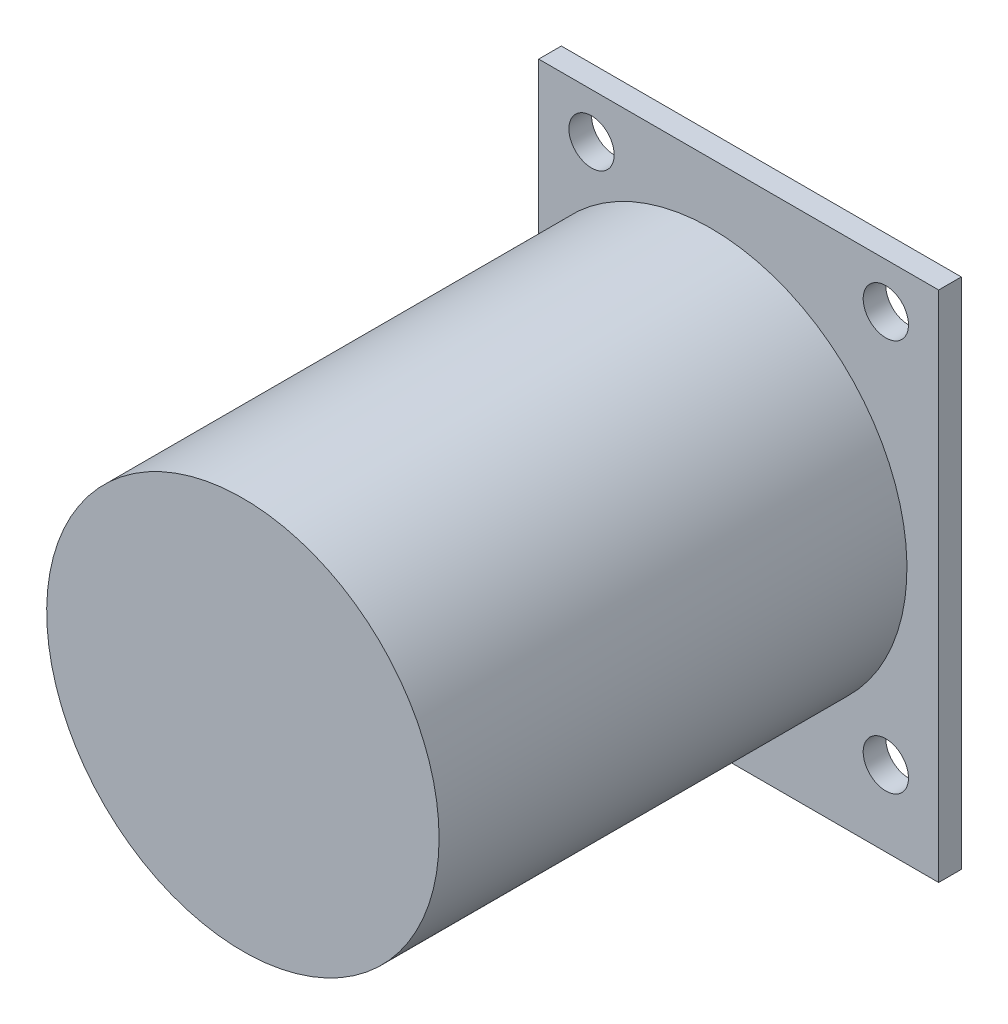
from build123d import *

# Parameters (mm, degrees)
SKETCH1_W           = 26.5
SKETCH1_H           = 34
SKETCH1_R           = 1.5
BOSS_EXTRUDE1_DEPTH = 1.5
SKETCH1_4_R         = 13
BOSS_EXTRUDE2_DEPTH = 31


with BuildPart() as part:
    # Sketch1 → Boss-Extrude1 (new body)
    with BuildSketch(Plane.XY):
        Rectangle(SKETCH1_W, SKETCH1_H)
        with Locations((-9.75, 14)):
            Circle(SKETCH1_R, mode=Mode.SUBTRACT)
        with Locations((-9.75, -12)):
            Circle(SKETCH1_R, mode=Mode.SUBTRACT)
        with Locations((9.75, 14)):
            Circle(SKETCH1_R, mode=Mode.SUBTRACT)
        with Locations((9.75, -12)):
            Circle(SKETCH1_R, mode=Mode.SUBTRACT)
    extrude(amount=-BOSS_EXTRUDE1_DEPTH)

    # Sketch1_4 → Boss-Extrude2 (add)
    with BuildSketch(Plane.XY):
        with Locations(Location((-1.85, 0, 0), (0, 0, 151.273394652))):
            Circle(SKETCH1_4_R)
    extrude(amount=BOSS_EXTRUDE2_DEPTH)


solid = part.part
